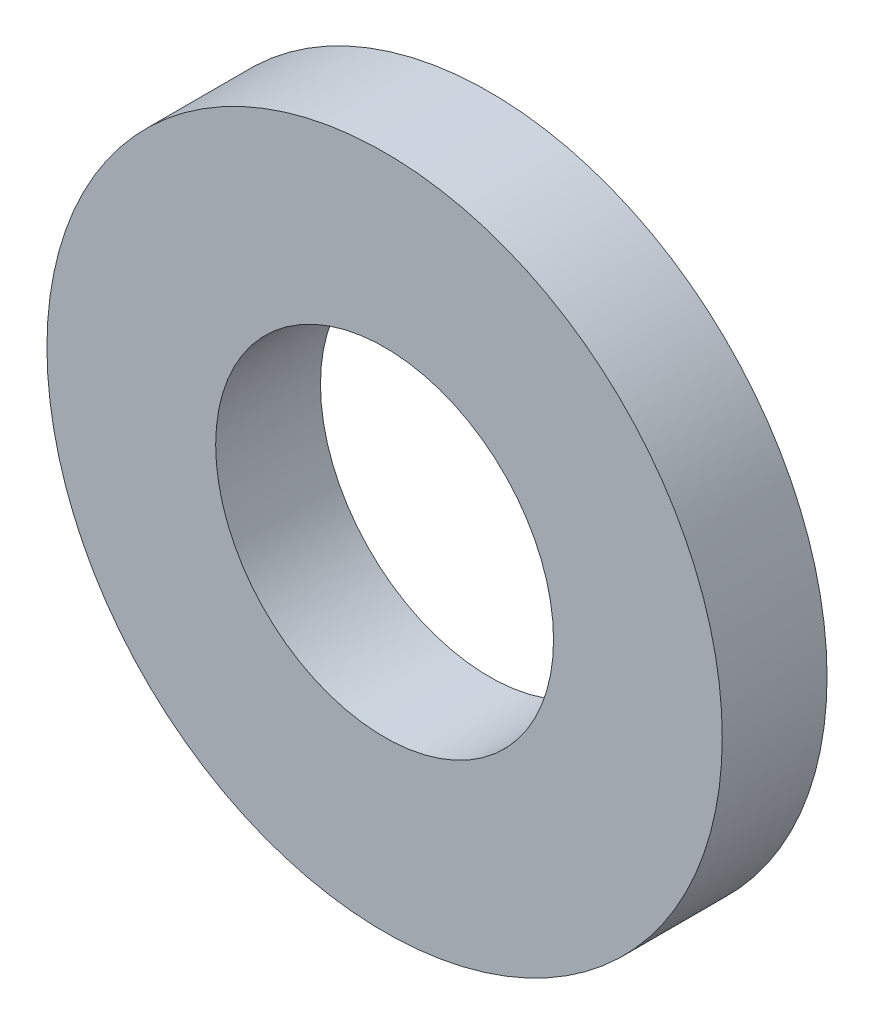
ISO-10303-21;
HEADER;
FILE_DESCRIPTION(('STEP AP214'),'2;1');
FILE_NAME('part.step','',(''),(''),'','','');
FILE_SCHEMA(('AUTOMOTIVE_DESIGN { 1 0 10303 214 1 1 1 1 }'));
ENDSEC;
DATA;
#1=APPLICATION_CONTEXT('core data for automotive mechanical design processes');
#2=APPLICATION_PROTOCOL_DEFINITION('international standard','automotive_design',2000,#1);
#3=PRODUCT_CONTEXT('',#1,'mechanical');
#4=PRODUCT('Part','Part','',(#3));
#5=PRODUCT_RELATED_PRODUCT_CATEGORY('part','',(#4));
#6=PRODUCT_DEFINITION_FORMATION('','',#4);
#7=PRODUCT_DEFINITION_CONTEXT('part definition',#1,'design');
#8=PRODUCT_DEFINITION('design','',#6,#7);
#9=PRODUCT_DEFINITION_SHAPE('','',#8);
#10=(LENGTH_UNIT() NAMED_UNIT(*) SI_UNIT(.MILLI.,.METRE.));
#11=(NAMED_UNIT(*) PLANE_ANGLE_UNIT() SI_UNIT($,.RADIAN.));
#12=(NAMED_UNIT(*) SI_UNIT($,.STERADIAN.) SOLID_ANGLE_UNIT());
#13=UNCERTAINTY_MEASURE_WITH_UNIT(LENGTH_MEASURE(1.E-05),#10,'distance_accuracy_value','');
#14=(GEOMETRIC_REPRESENTATION_CONTEXT(3) GLOBAL_UNCERTAINTY_ASSIGNED_CONTEXT((#13)) GLOBAL_UNIT_ASSIGNED_CONTEXT((#10,
#11,#12)) REPRESENTATION_CONTEXT('',''));
#15=CARTESIAN_POINT('',(0.,0.,0.));
#16=DIRECTION('',(0.,0.,1.));
#17=DIRECTION('',(1.,0.,0.));
#18=AXIS2_PLACEMENT_3D('',#15,#16,#17);
#19=CARTESIAN_POINT('',(0.,0.,-22.5427919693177));
#20=DIRECTION('',(0.,0.,-1.));
#21=DIRECTION('',(-1.,0.,0.));
#22=AXIS2_PLACEMENT_3D('',#19,#20,#21);
#23=CYLINDRICAL_SURFACE('',#22,5.159375);
#24=CARTESIAN_POINT('',(0.,0.,0.));
#25=DIRECTION('',(0.,0.,-1.));
#26=DIRECTION('',(-1.,0.,0.));
#27=AXIS2_PLACEMENT_3D('',#24,#25,#26);
#28=CIRCLE('',#27,5.159375);
#29=CARTESIAN_POINT('',(-5.159375,0.,0.));
#30=VERTEX_POINT('',#29);
#31=EDGE_CURVE('E10',#30,#30,#28,.T.);
#32=ORIENTED_EDGE('',*,*,#31,.F.);
#33=EDGE_LOOP('',(#32));
#34=FACE_BOUND('',#33,.T.);
#35=CARTESIAN_POINT('',(0.,0.,-3.2004));
#36=DIRECTION('',(0.,0.,-1.));
#37=DIRECTION('',(-1.,0.,0.));
#38=AXIS2_PLACEMENT_3D('',#35,#36,#37);
#39=CIRCLE('',#38,5.159375);
#40=CARTESIAN_POINT('',(-5.159375,0.,-3.2004));
#41=VERTEX_POINT('',#40);
#42=EDGE_CURVE('E60',#41,#41,#39,.T.);
#43=ORIENTED_EDGE('',*,*,#42,.T.);
#44=EDGE_LOOP('',(#43));
#45=FACE_BOUND('',#44,.T.);
#46=ADVANCED_FACE('F41',(#34,#45),#23,.F.);
#47=CARTESIAN_POINT('',(-5.159375,0.,0.));
#48=DIRECTION('',(0.,0.,-1.));
#49=DIRECTION('',(-1.,0.,0.));
#50=AXIS2_PLACEMENT_3D('',#47,#48,#49);
#51=PLANE('',#50);
#52=CARTESIAN_POINT('',(0.,0.,0.));
#53=DIRECTION('',(0.,0.,-1.));
#54=DIRECTION('',(-1.,0.,0.));
#55=AXIS2_PLACEMENT_3D('',#52,#53,#54);
#56=CIRCLE('',#55,10.3124);
#57=CARTESIAN_POINT('',(-10.3124,0.,0.));
#58=VERTEX_POINT('',#57);
#59=EDGE_CURVE('E48',#58,#58,#56,.T.);
#60=ORIENTED_EDGE('',*,*,#59,.F.);
#61=EDGE_LOOP('',(#60));
#62=FACE_BOUND('',#61,.T.);
#63=ORIENTED_EDGE('',*,*,#31,.T.);
#64=EDGE_LOOP('',(#63));
#65=FACE_BOUND('',#64,.T.);
#66=ADVANCED_FACE('F77',(#62,#65),#51,.F.);
#67=CARTESIAN_POINT('',(0.,0.,-22.5427919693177));
#68=DIRECTION('',(0.,0.,-1.));
#69=DIRECTION('',(-1.,0.,0.));
#70=AXIS2_PLACEMENT_3D('',#67,#68,#69);
#71=CYLINDRICAL_SURFACE('',#70,10.3124);
#72=CARTESIAN_POINT('',(0.,0.,-3.2004));
#73=DIRECTION('',(0.,0.,-1.));
#74=DIRECTION('',(-1.,0.,0.));
#75=AXIS2_PLACEMENT_3D('',#72,#73,#74);
#76=CIRCLE('',#75,10.3124);
#77=CARTESIAN_POINT('',(-10.3124,0.,-3.2004));
#78=VERTEX_POINT('',#77);
#79=EDGE_CURVE('E54',#78,#78,#76,.T.);
#80=ORIENTED_EDGE('',*,*,#79,.F.);
#81=EDGE_LOOP('',(#80));
#82=FACE_BOUND('',#81,.T.);
#83=ORIENTED_EDGE('',*,*,#59,.T.);
#84=EDGE_LOOP('',(#83));
#85=FACE_BOUND('',#84,.T.);
#86=ADVANCED_FACE('F72',(#82,#85),#71,.T.);
#87=CARTESIAN_POINT('',(-10.3124,0.,-3.2004));
#88=DIRECTION('',(0.,0.,1.));
#89=DIRECTION('',(1.,0.,0.));
#90=AXIS2_PLACEMENT_3D('',#87,#88,#89);
#91=PLANE('',#90);
#92=ORIENTED_EDGE('',*,*,#42,.F.);
#93=EDGE_LOOP('',(#92));
#94=FACE_BOUND('',#93,.T.);
#95=ORIENTED_EDGE('',*,*,#79,.T.);
#96=EDGE_LOOP('',(#95));
#97=FACE_BOUND('',#96,.T.);
#98=ADVANCED_FACE('F69',(#94,#97),#91,.F.);
#99=CLOSED_SHELL('',(#46,#66,#86,#98));
#100=MANIFOLD_SOLID_BREP('B2',#99);
#101=ADVANCED_BREP_SHAPE_REPRESENTATION('',(#18,#100),#14);
#102=SHAPE_DEFINITION_REPRESENTATION(#9,#101);
ENDSEC;
END-ISO-10303-21;
